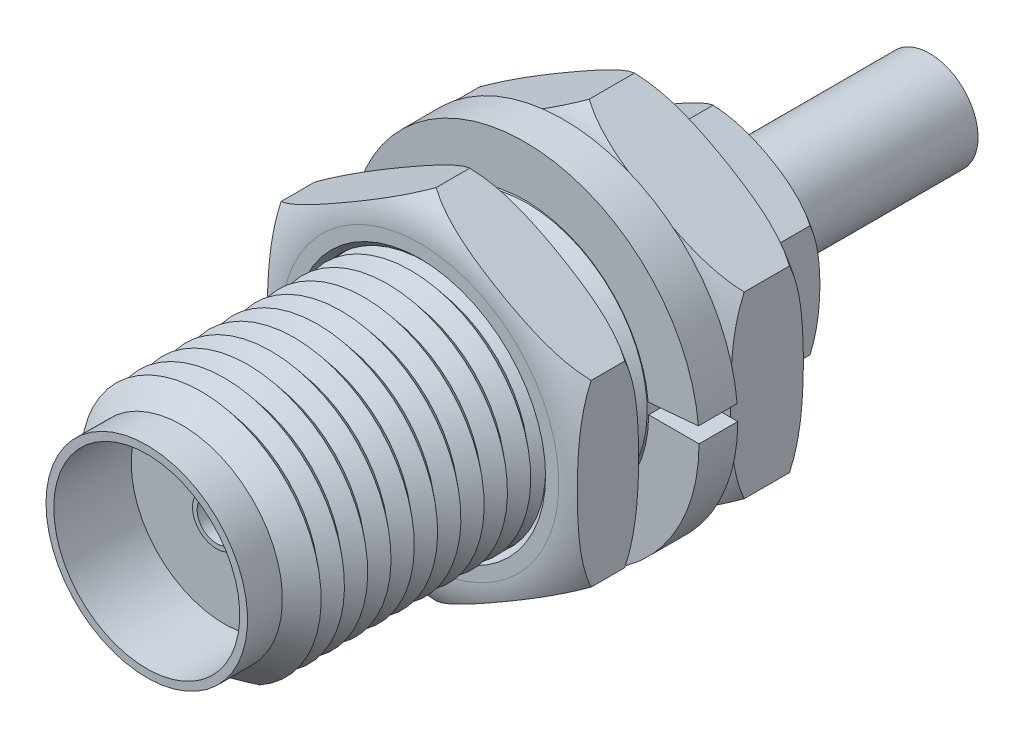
from build123d import *

# Parameters (mm, degrees)
CUT_EXTRUDE_1_DEPTH             = 13.852237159
CUT_EXTRUDE_1_DEPTH_BACK        = 13.852237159
SKETCH_2_OUTSIDE_W              = 16.236
SKETCH_2_OUTSIDE_H              = 16.236
SKETCH_3_OUTSIDE_W              = 14.722
SKETCH_3_OUTSIDE_H              = 15.96
CUT_EXTRUDE_2_DEPTH             = 2
REVOLVE_3_ANGLE                 = 355
CUT_EXTRUDE_3_REACH             = 14.279
CUT_EXTRUDE_3_DIRECTION_2_DEPTH = 13.279488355


with BuildPart() as part:
    # Sketch 1 → Revolve 1 (revolve)
    with BuildSketch(Plane(origin=(0, 0, 0), x_dir=(1, 0, 0), z_dir=(0, 1, 0)), mode=Mode.PRIVATE) as revolve_1_sk:
        with BuildLine():
            Line((0, 0), (0.5, 0))
            Line((0.5, 0), (0.5, -7.95))
            Line((0.5, -7.95), (0.62, -7.95))
            Line((0.62, -7.95), (0.62, -7.75))
            Line((0.62, -7.75), (2.4, -7.75))
            Line((2.4, -7.75), (2.4, -9.75))
            Line((2.4, -9.75), (2.6, -9.75))
            Line((2.6, -9.75), (2.6, -8.85))
            Line((2.6, -8.85), (3.1, -8.35))
            Line((3.1, -8.35), (3.1, -2.7))
            Line((3.1, -2.7), (3.581966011, -2.7))
            ThreePointArc((3.581966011, -2.7), (4.194338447, -2.569306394), (4.7, -2.2))
            Line((4.7, -2.2), (4.7, -1.5))
            ThreePointArc((4.7, -1.5), (4.194338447, -1.130693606), (3.581966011, -1))
            Line((3.581966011, -1), (3.1, -1))
            Line((3.1, -1), (3.1, 1.25))
            Line((3.1, 1.25), (3.581966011, 1.25))
            ThreePointArc((3.581966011, 1.25), (4.194338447, 1.380693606), (4.7, 1.75))
            Line((4.7, 1.75), (4.7, 2.75))
            ThreePointArc((4.7, 2.75), (4.194338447, 3.119306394), (3.581966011, 3.25))
            Line((3.581966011, 3.25), (3, 3.25))
            Line((3, 3.25), (3, 4.75))
            ThreePointArc((3, 4.75), (2.494338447, 5.119306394), (1.881966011, 5.25))
            Line((1.881966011, 5.25), (1.25, 5.25))
            Line((1.25, 5.25), (1.25, 10.45))
            Line((1.25, 10.45), (1, 10.45))
            Line((1, 10.45), (1, 5.25))
            Line((1, 5.25), (0, 5.25))
            Line((0, 5.25), (0, 0))
        make_face()
    revolve(revolve_1_sk.sketch.rotate(Axis((0, 0, 0), (0, 0, 1)), 180), axis=Axis((0, 0, 0), (0, 0, 1)))

    # Sketch 2 outside → Cut-Extrude 1 (cut, two sides: drawn at the far end of the back side and taken through both)
    with BuildSketch(Plane.XY.offset(-1.25).offset(-CUT_EXTRUDE_1_DEPTH_BACK)):
        Rectangle(SKETCH_2_OUTSIDE_W, SKETCH_2_OUTSIDE_H)
        Polygon((0, 4.618802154), (-4, 2.309401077), (-4, -2.309401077), (0, -4.618802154), (4, -2.309401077), (4, 2.309401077), align=None, mode=Mode.SUBTRACT)
    extrude(amount=CUT_EXTRUDE_1_DEPTH + CUT_EXTRUDE_1_DEPTH_BACK, mode=Mode.SUBTRACT)

    # Sketch 3 outside → Cut-Extrude 2 (cut)
    with BuildSketch(Plane(origin=(0, 0, -5.25), x_dir=(-1, 0, 0), z_dir=(0, 0, -1))):
        Rectangle(SKETCH_3_OUTSIDE_W, SKETCH_3_OUTSIDE_H)
        Polygon((0, 2.886751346), (-2.5, 1.443375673), (-2.5, -1.443375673), (0, -2.886751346), (2.5, -1.443375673), (2.5, 1.443375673), align=None, mode=Mode.SUBTRACT)
    extrude(amount=-CUT_EXTRUDE_2_DEPTH, mode=Mode.SUBTRACT)

    # Sketch 4 → Cut-Revolve 1 (revolve, cut)
    with BuildSketch(Plane(origin=(0, 0, 0), x_dir=(1, 0, 0), z_dir=(0, 1, 0)), mode=Mode.PRIVATE) as cut_revolve_1_sk:
        Polygon((3.1, -8.35), (2.741961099, -8.04956969), (3.1, -7.749139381), (2.741961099, -7.448709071), (3.1, -7.148278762), (2.741961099, -6.847848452), (3.1, -6.547418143), (2.741961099, -6.246987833), (3.1, -5.946557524), (2.741961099, -5.646127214), (3.1, -5.345696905), (2.741961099, -5.045266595), (3.1, -4.744836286), (2.741961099, -4.444405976), (3.1, -4.143975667), (2.741961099, -3.843545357), (3.1, -3.543115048), (2.741961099, -3.242684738), (3.1, -2.942254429), (2.741961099, -2.641824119), (3.1, -2.34139381), (3.1, -2.560327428), (3.239672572, -2.7), (4.6, -2.7), (4.6, -8.35), align=None)
        Polygon((3.1, 0.662909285), (4.6, 0.662909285), (4.6, -1), (3.239672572, -1), (3.1, -1.139672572), (2.741961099, -0.839242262), (3.1, -0.538811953), (2.741961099, -0.238381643), (3.1, 0.062048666), (2.741961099, 0.362478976), align=None)
    revolve(cut_revolve_1_sk.sketch.rotate(Axis((0, 0, 0), (0, 0, 1)), 180), axis=Axis((0, 0, 0), (0, 0, 1)), mode=Mode.SUBTRACT)

    # Sketch 5 → Revolve 3 (revolve)
    with BuildSketch(Plane(origin=(0, 0, 0), x_dir=(1, 0, 0), z_dir=(0, 1, 0))):
        Polygon((3.1, 1), (4.5, 1), (4.5, 0), (3.2, 0), (3.2, 0.662909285), (3.1, 0.662909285), align=None)
    revolve(axis=Axis((0, 0, 0), (0, 0, -1)), revolution_arc=REVOLVE_3_ANGLE)

    # Cut-Extrude 3: up to this face of the body (flat: up to its plane)
    cut_extrude_3_end = Plane(part.part.faces().sort_by_distance((3.201313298, 0, -1.25))[0])
    # Sketch 6 → Cut-Extrude 3 (cut, up to the picked face)
    with BuildSketch(Plane.XY, mode=Mode.PRIVATE) as cut_extrude_3_sk1:
        with BuildLine():
            Line((-1.523154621, -2.7), (1.523154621, -2.7))
            ThreePointArc((1.523154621, -2.7), (0, -3.1), (-1.523154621, -2.7))
        make_face()
    cut_extrude_3_tool1 = split(extrude(cut_extrude_3_sk1.sketch, amount=-CUT_EXTRUDE_3_REACH, mode=Mode.PRIVATE), bisect_by=cut_extrude_3_end, keep=Keep.BOTH, mode=Mode.PRIVATE)
    add(cut_extrude_3_tool1.solids().sort_by(Axis((0, -2.860919, 0), (0, 0, -1)))[0], mode=Mode.SUBTRACT)

    # Sketch 6 → Cut-Extrude 3 direction 2 (cut)
    with BuildSketch(Plane.XY):
        with BuildLine():
            Line((-1.523154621, -2.7), (1.523154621, -2.7))
            ThreePointArc((1.523154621, -2.7), (0, -3.1), (-1.523154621, -2.7))
        make_face()
    extrude(amount=CUT_EXTRUDE_3_DIRECTION_2_DEPTH, mode=Mode.SUBTRACT)


solid = part.part
